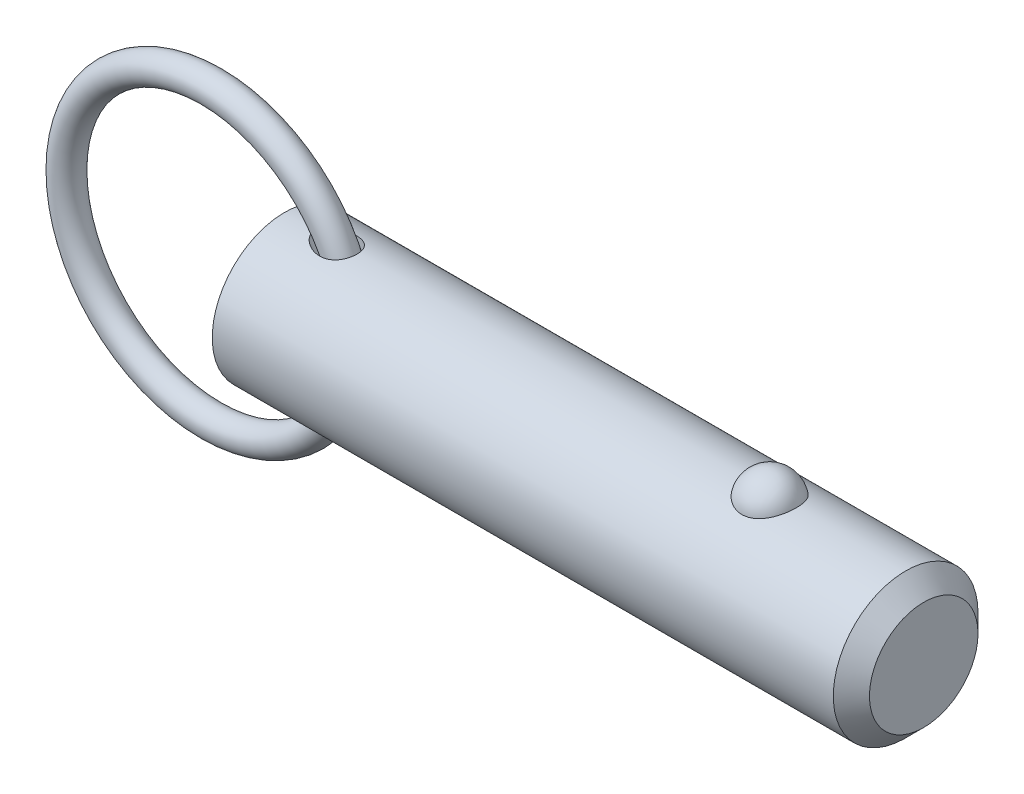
ISO-10303-21;
HEADER;
FILE_DESCRIPTION(('STEP AP214'),'2;1');
FILE_NAME('part.step','',(''),(''),'','','');
FILE_SCHEMA(('AUTOMOTIVE_DESIGN { 1 0 10303 214 1 1 1 1 }'));
ENDSEC;
DATA;
#1=APPLICATION_CONTEXT('core data for automotive mechanical design processes');
#2=APPLICATION_PROTOCOL_DEFINITION('international standard','automotive_design',2000,#1);
#3=PRODUCT_CONTEXT('',#1,'mechanical');
#4=PRODUCT('Part','Part','',(#3));
#5=PRODUCT_RELATED_PRODUCT_CATEGORY('part','',(#4));
#6=PRODUCT_DEFINITION_FORMATION('','',#4);
#7=PRODUCT_DEFINITION_CONTEXT('part definition',#1,'design');
#8=PRODUCT_DEFINITION('design','',#6,#7);
#9=PRODUCT_DEFINITION_SHAPE('','',#8);
#10=(LENGTH_UNIT() NAMED_UNIT(*) SI_UNIT(.MILLI.,.METRE.));
#11=(NAMED_UNIT(*) PLANE_ANGLE_UNIT() SI_UNIT($,.RADIAN.));
#12=(NAMED_UNIT(*) SI_UNIT($,.STERADIAN.) SOLID_ANGLE_UNIT());
#13=UNCERTAINTY_MEASURE_WITH_UNIT(LENGTH_MEASURE(1.E-05),#10,'distance_accuracy_value','');
#14=(GEOMETRIC_REPRESENTATION_CONTEXT(3) GLOBAL_UNCERTAINTY_ASSIGNED_CONTEXT((#13)) GLOBAL_UNIT_ASSIGNED_CONTEXT((#10,
#11,#12)) REPRESENTATION_CONTEXT('',''));
#15=CARTESIAN_POINT('',(0.,0.,0.));
#16=DIRECTION('',(0.,0.,1.));
#17=DIRECTION('',(1.,0.,0.));
#18=AXIS2_PLACEMENT_3D('',#15,#16,#17);
#19=CARTESIAN_POINT('',(-9.66825126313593,0.,0.));
#20=DIRECTION('',(0.,0.,1.));
#21=DIRECTION('',(1.,0.,0.));
#22=AXIS2_PLACEMENT_3D('',#19,#20,#21);
#23=TOROIDAL_SURFACE('',#22,19.05,1.905);
#24=CARTESIAN_POINT('',(11.2867487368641,0.,0.));
#25=VERTEX_POINT('',#24);
#26=VERTEX_LOOP('',#25);
#27=FACE_BOUND('',#26,.T.);
#28=ADVANCED_FACE('P0_F12',(#27),#23,.T.);
#29=CLOSED_SHELL('',(#28));
#30=MANIFOLD_SOLID_BREP('P0_B1',#29);
#31=CARTESIAN_POINT('',(0.,0.,0.));
#32=DIRECTION('',(1.,0.,0.));
#33=DIRECTION('',(0.,0.,-1.));
#34=AXIS2_PLACEMENT_3D('',#31,#32,#33);
#35=CYLINDRICAL_SURFACE('',#34,9.525);
#36=CARTESIAN_POINT('',(4.56693409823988,9.43141941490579,-1.33189820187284));
#37=CARTESIAN_POINT('',(4.70260475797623,9.41020313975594,-1.48215931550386));
#38=CARTESIAN_POINT('',(4.85555680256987,9.38755003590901,-1.61683982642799));
#39=CARTESIAN_POINT('',(5.10171959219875,9.35450554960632,-1.79512943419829));
#40=CARTESIAN_POINT('',(5.18674514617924,9.34362629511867,-1.85068909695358));
#41=CARTESIAN_POINT('',(5.36154389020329,9.32258514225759,-1.95392002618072));
#42=CARTESIAN_POINT('',(5.45131542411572,9.31242299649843,-2.00159402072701));
#43=CARTESIAN_POINT('',(5.70070211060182,9.28632120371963,-2.12033289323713));
#44=CARTESIAN_POINT('',(5.86420408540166,9.27146938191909,-2.18362944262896));
#45=CARTESIAN_POINT('',(6.19893345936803,9.24694163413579,-2.28525783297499));
#46=CARTESIAN_POINT('',(6.37015384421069,9.23726110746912,-2.32361187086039));
#47=CARTESIAN_POINT('',(6.73531776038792,9.22400982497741,-2.37575048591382));
#48=CARTESIAN_POINT('',(6.92975826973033,9.22118808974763,-2.38652934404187));
#49=CARTESIAN_POINT('',(7.21995443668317,9.22416297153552,-2.37494980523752));
#50=CARTESIAN_POINT('',(7.31643847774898,9.22635560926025,-2.366466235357));
#51=CARTESIAN_POINT('',(7.50796421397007,9.2331428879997,-2.33985028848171));
#52=CARTESIAN_POINT('',(7.60300650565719,9.23773650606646,-2.32172202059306));
#53=CARTESIAN_POINT('',(7.83273114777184,9.25183311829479,-2.26504721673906));
#54=CARTESIAN_POINT('',(7.96603028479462,9.26261470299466,-2.2209856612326));
#55=CARTESIAN_POINT('',(8.22310899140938,9.28816519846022,-2.11157306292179));
#56=CARTESIAN_POINT('',(8.34689477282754,9.30293147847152,-2.04623606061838));
#57=CARTESIAN_POINT('',(8.58136049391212,9.3349416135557,-1.89485344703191));
#58=CARTESIAN_POINT('',(8.69199721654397,9.35219324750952,-1.80874222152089));
#59=CARTESIAN_POINT('',(8.89592093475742,9.38707016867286,-1.61799188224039));
#60=CARTESIAN_POINT('',(8.98920771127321,9.40469546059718,-1.51335253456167));
#61=CARTESIAN_POINT('',(9.15057731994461,9.43713590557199,-1.29519427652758));
#62=CARTESIAN_POINT('',(9.21980158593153,9.45205440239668,-1.18253282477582));
#63=CARTESIAN_POINT('',(9.33826736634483,9.47856708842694,-0.946802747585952));
#64=CARTESIAN_POINT('',(9.38751161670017,9.49016173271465,-0.823735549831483));
#65=CARTESIAN_POINT('',(9.46423850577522,9.50859378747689,-0.572614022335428));
#66=CARTESIAN_POINT('',(9.49202393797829,9.5154972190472,-0.444656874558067));
#67=CARTESIAN_POINT('',(9.52636926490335,9.52406905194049,-0.185752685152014));
#68=CARTESIAN_POINT('',(9.53292923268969,9.52573747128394,-0.0548056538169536));
#69=CARTESIAN_POINT('',(9.52467276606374,9.52365852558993,0.206503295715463));
#70=CARTESIAN_POINT('',(9.50983454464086,9.51990564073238,0.336864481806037));
#71=CARTESIAN_POINT('',(9.45907362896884,9.50737852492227,0.59316631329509));
#72=CARTESIAN_POINT('',(9.42315106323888,9.49860432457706,0.71910698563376));
#73=CARTESIAN_POINT('',(9.33106648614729,9.47698928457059,0.96295935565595));
#74=CARTESIAN_POINT('',(9.27490839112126,9.46414923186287,1.08087260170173));
#75=CARTESIAN_POINT('',(9.14375803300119,9.43581000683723,1.30534632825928));
#76=CARTESIAN_POINT('',(9.06876720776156,9.42031103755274,1.41190767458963));
#77=CARTESIAN_POINT('',(8.90203187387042,9.38836719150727,1.61069439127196));
#78=CARTESIAN_POINT('',(8.81029913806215,9.37192298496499,1.70292975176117));
#79=CARTESIAN_POINT('',(8.61268775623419,9.33985045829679,1.87086859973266));
#80=CARTESIAN_POINT('',(8.50680947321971,9.3242221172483,1.94657251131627));
#81=CARTESIAN_POINT('',(8.28220546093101,9.29513431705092,2.08109032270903));
#82=CARTESIAN_POINT('',(8.16329919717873,9.28171415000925,2.1396103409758));
#83=CARTESIAN_POINT('',(7.91756052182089,9.25859072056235,2.23755716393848));
#84=CARTESIAN_POINT('',(7.79072606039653,9.24888842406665,2.27697900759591));
#85=CARTESIAN_POINT('',(7.52377913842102,9.23338749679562,2.33907806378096));
#86=CARTESIAN_POINT('',(7.38334767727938,9.22789571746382,2.36044900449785));
#87=CARTESIAN_POINT('',(7.10081394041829,9.22210229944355,2.3829751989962));
#88=CARTESIAN_POINT('',(6.95871103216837,9.22180269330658,2.38412253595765));
#89=CARTESIAN_POINT('',(6.65642691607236,9.22632724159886,2.36656230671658));
#90=CARTESIAN_POINT('',(6.49641694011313,9.23185415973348,2.3451317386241));
#91=CARTESIAN_POINT('',(6.18115433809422,9.24811737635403,2.28014143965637));
#92=CARTESIAN_POINT('',(6.02590710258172,9.25885936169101,2.23655754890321));
#93=CARTESIAN_POINT('',(5.6990472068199,9.28624254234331,2.12025087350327));
#94=CARTESIAN_POINT('',(5.52873601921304,9.30354853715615,2.04400672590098));
#95=CARTESIAN_POINT('',(5.20289495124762,9.34106989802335,1.86504730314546));
#96=CARTESIAN_POINT('',(5.04735968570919,9.36128419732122,1.76234172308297));
#97=CARTESIAN_POINT('',(4.79287124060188,9.39697639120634,1.55895334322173));
#98=CARTESIAN_POINT('',(4.68938704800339,9.41240250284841,1.46392900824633));
#99=CARTESIAN_POINT('',(4.49847141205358,9.44202586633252,1.25875918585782));
#100=CARTESIAN_POINT('',(4.41101129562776,9.45622528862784,1.1486413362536));
#101=CARTESIAN_POINT('',(4.27502257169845,9.47888210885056,0.940600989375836));
#102=CARTESIAN_POINT('',(4.22216329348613,9.48791121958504,0.845586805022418));
#103=CARTESIAN_POINT('',(4.13241478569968,9.50344321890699,0.648051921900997));
#104=CARTESIAN_POINT('',(4.09551182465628,9.50994827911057,0.545537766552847));
#105=CARTESIAN_POINT('',(4.04043124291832,9.51971586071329,0.334452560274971));
#106=CARTESIAN_POINT('',(4.02240728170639,9.52295176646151,0.225839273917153));
#107=CARTESIAN_POINT('',(4.00750873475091,9.52562364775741,0.00713006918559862));
#108=CARTESIAN_POINT('',(4.01062334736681,9.52506156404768,-0.10296506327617));
#109=CARTESIAN_POINT('',(4.03592967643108,9.52053221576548,-0.306944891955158));
#110=CARTESIAN_POINT('',(4.05571676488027,9.51699426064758,-0.401151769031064));
#111=CARTESIAN_POINT('',(4.10967975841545,9.5074546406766,-0.585176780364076));
#112=CARTESIAN_POINT('',(4.14385995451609,9.50145224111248,-0.674993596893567));
#113=CARTESIAN_POINT('',(4.23261356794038,9.48611703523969,-0.866116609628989));
#114=CARTESIAN_POINT('',(4.28990016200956,9.47635800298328,-0.96612166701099));
#115=CARTESIAN_POINT('',(4.41856577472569,9.45502867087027,-1.15640011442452));
#116=CARTESIAN_POINT('',(4.48996918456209,9.44345524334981,-1.24665623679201));
#117=CARTESIAN_POINT('',(4.56693409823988,9.43141941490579,-1.33189820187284));
#118=B_SPLINE_CURVE_WITH_KNOTS('',3,(#36,#37,#38,#39,#40,#41,#42,#43,#44,#45,#46,#47,#48,#49,
#50,#51,#52,#53,#54,#55,#56,#57,#58,#59,#60,#61,#62,#63,#64,#65,#66,#67,#68,#69,#70,#71,#72,#73,
#74,#75,#76,#77,#78,#79,#80,#81,#82,#83,#84,#85,#86,#87,#88,#89,#90,#91,#92,#93,#94,#95,#96,#97,
#98,#99,#100,#101,#102,#103,#104,#105,#106,#107,#108,#109,#110,#111,#112,#113,#114,#115,#116,
#117),.UNSPECIFIED.,.T.,.F.,(4,2,2,2,2,2,2,2,2,2,2,2,2,2,2,2,2,2,2,2,2,2,2,2,2,2,2,2,2,2,2,2,2,
2,2,2,2,2,2,2,4),(0.,0.609951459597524,0.916123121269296,1.22218863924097,1.74791337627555,
2.27316961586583,2.85362722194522,3.14383229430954,3.43391382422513,3.85437497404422,
4.27455920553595,4.69608835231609,5.11762282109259,5.5149005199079,5.91212379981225,
6.30363414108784,6.69514313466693,7.08705103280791,7.47895654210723,7.87078624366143,
8.26258603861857,8.65411137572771,9.04562666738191,9.44349251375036,9.84146165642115,
10.2662286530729,10.6911619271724,11.1739180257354,11.6572017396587,12.2170157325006,
12.776624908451,13.1992556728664,13.6211226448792,13.9471990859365,14.2729943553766,
14.6014211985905,14.9296802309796,15.2173810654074,15.505167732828,15.8505863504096,
16.1966070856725),.UNSPECIFIED.);
#119=CARTESIAN_POINT('',(4.56693409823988,9.43141941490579,-1.33189820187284));
#120=VERTEX_POINT('',#119);
#121=EDGE_CURVE('P1_E40',#120,#120,#118,.T.);
#122=ORIENTED_EDGE('',*,*,#121,.T.);
#123=EDGE_LOOP('',(#122));
#124=FACE_BOUND('',#123,.T.);
#125=CARTESIAN_POINT('',(81.74875,0.,0.));
#126=DIRECTION('',(1.,0.,0.));
#127=DIRECTION('',(0.,0.,-1.));
#128=AXIS2_PLACEMENT_3D('',#125,#126,#127);
#129=CIRCLE('',#128,9.525);
#130=CARTESIAN_POINT('',(81.74875,0.,-9.525));
#131=VERTEX_POINT('',#130);
#132=EDGE_CURVE('P1_E25',#131,#131,#129,.T.);
#133=ORIENTED_EDGE('',*,*,#132,.F.);
#134=EDGE_LOOP('',(#133));
#135=FACE_BOUND('',#134,.T.);
#136=CARTESIAN_POINT('',(0.,0.,0.));
#137=DIRECTION('',(1.,0.,0.));
#138=DIRECTION('',(0.,0.,-1.));
#139=AXIS2_PLACEMENT_3D('',#136,#137,#138);
#140=CIRCLE('',#139,9.525);
#141=CARTESIAN_POINT('',(0.,0.,-9.525));
#142=VERTEX_POINT('',#141);
#143=EDGE_CURVE('P1_E9',#142,#142,#140,.T.);
#144=ORIENTED_EDGE('',*,*,#143,.T.);
#145=EDGE_LOOP('',(#144));
#146=FACE_BOUND('',#145,.T.);
#147=CARTESIAN_POINT('',(63.8457573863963,8.80405803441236,3.63513233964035));
#148=CARTESIAN_POINT('',(63.7516766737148,8.80405953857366,3.63513053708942));
#149=CARTESIAN_POINT('',(63.6575618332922,8.80561325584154,3.6313746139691));
#150=CARTESIAN_POINT('',(63.4700126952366,8.81177748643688,3.61638665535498));
#151=CARTESIAN_POINT('',(63.3765788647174,8.81638992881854,3.60514990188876));
#152=CARTESIAN_POINT('',(63.0979452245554,8.8346711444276,3.56024627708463));
#153=CARTESIAN_POINT('',(62.9146916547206,8.85278327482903,3.51538626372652));
#154=CARTESIAN_POINT('',(62.559509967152,8.89871214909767,3.39742145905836));
#155=CARTESIAN_POINT('',(62.3875533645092,8.92650327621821,3.32439116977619));
#156=CARTESIAN_POINT('',(62.0587075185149,8.98874819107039,3.15220244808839));
#157=CARTESIAN_POINT('',(61.9018114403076,9.02319893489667,3.05305594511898));
#158=CARTESIAN_POINT('',(61.6022147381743,9.09629186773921,2.82797815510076));
#159=CARTESIAN_POINT('',(61.4600600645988,9.13502685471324,2.7013513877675));
#160=CARTESIAN_POINT('',(61.1982999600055,9.2118657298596,2.4264193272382));
#161=CARTESIAN_POINT('',(61.0787015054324,9.2499694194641,2.27810735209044));
#162=CARTESIAN_POINT('',(60.859645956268,9.32341082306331,1.95652290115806));
#163=CARTESIAN_POINT('',(60.7613174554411,9.35855090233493,1.78243511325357));
#164=CARTESIAN_POINT('',(60.5938190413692,9.42045142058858,1.41937246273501));
#165=CARTESIAN_POINT('',(60.5246511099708,9.44721128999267,1.23039658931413));
#166=CARTESIAN_POINT('',(60.4161994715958,9.48990641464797,0.840370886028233));
#167=CARTESIAN_POINT('',(60.3772880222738,9.50570658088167,0.639202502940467));
#168=CARTESIAN_POINT('',(60.3315550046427,9.52433146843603,0.232664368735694));
#169=CARTESIAN_POINT('',(60.3247324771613,9.52715657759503,0.0272947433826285));
#170=CARTESIAN_POINT('',(60.343255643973,9.51956918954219,-0.380478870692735));
#171=CARTESIAN_POINT('',(60.3684052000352,9.50923740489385,-0.582893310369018));
#172=CARTESIAN_POINT('',(60.4500253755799,9.47651897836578,-0.980293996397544));
#173=CARTESIAN_POINT('',(60.5064966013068,9.45413210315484,-1.17528009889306));
#174=CARTESIAN_POINT('',(60.6497192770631,9.39954044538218,-1.55263697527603));
#175=CARTESIAN_POINT('',(60.7365124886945,9.36732213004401,-1.73498993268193));
#176=CARTESIAN_POINT('',(60.9386103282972,9.29640700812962,-2.08177763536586));
#177=CARTESIAN_POINT('',(61.0539172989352,9.25770966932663,-2.24621090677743));
#178=CARTESIAN_POINT('',(61.311264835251,9.17775604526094,-2.5533833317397));
#179=CARTESIAN_POINT('',(61.4534344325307,9.136488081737,-2.69601150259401));
#180=CARTESIAN_POINT('',(61.76089985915,9.05620497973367,-2.95451229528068));
#181=CARTESIAN_POINT('',(61.9261937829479,9.01718965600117,-3.07038711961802));
#182=CARTESIAN_POINT('',(62.272052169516,8.9468001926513,-3.26976836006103));
#183=CARTESIAN_POINT('',(62.4522278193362,8.91528408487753,-3.35389750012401));
#184=CARTESIAN_POINT('',(62.8256514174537,8.86272514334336,-3.49043503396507));
#185=CARTESIAN_POINT('',(63.0188944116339,8.8416783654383,-3.54285537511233));
#186=CARTESIAN_POINT('',(63.4025036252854,8.81348056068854,-3.61241306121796));
#187=CARTESIAN_POINT('',(63.5925251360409,8.80568348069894,-3.63119339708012));
#188=CARTESIAN_POINT('',(63.9731906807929,8.80289410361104,-3.63795342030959));
#189=CARTESIAN_POINT('',(64.1638345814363,8.80789922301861,-3.62593932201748));
#190=CARTESIAN_POINT('',(64.534007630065,8.8297491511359,-3.57238430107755));
#191=CARTESIAN_POINT('',(64.7136976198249,8.84621463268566,-3.53178890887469));
#192=CARTESIAN_POINT('',(65.063422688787,8.88875330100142,-3.42331083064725));
#193=CARTESIAN_POINT('',(65.2334569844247,8.91482726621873,-3.35542593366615));
#194=CARTESIAN_POINT('',(65.5632377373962,8.97448239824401,-3.19248225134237));
#195=CARTESIAN_POINT('',(65.7226801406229,9.00821446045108,-3.09686474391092));
#196=CARTESIAN_POINT('',(66.0235136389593,9.07935398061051,-2.88162736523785));
#197=CARTESIAN_POINT('',(66.1649005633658,9.11676228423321,-2.76200196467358));
#198=CARTESIAN_POINT('',(66.4333193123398,9.19347419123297,-2.49516285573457));
#199=CARTESIAN_POINT('',(66.5592750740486,9.23277872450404,-2.34686614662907));
#200=CARTESIAN_POINT('',(66.7855227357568,9.30737610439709,-2.03093683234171));
#201=CARTESIAN_POINT('',(66.8858100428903,9.34266823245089,-1.86330077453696));
#202=CARTESIAN_POINT('',(67.0615149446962,9.40674710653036,-1.50744893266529));
#203=CARTESIAN_POINT('',(67.136041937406,9.4352917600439,-1.31874876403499));
#204=CARTESIAN_POINT('',(67.2541650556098,9.48144132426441,-0.930631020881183));
#205=CARTESIAN_POINT('',(67.2977608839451,9.49904612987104,-0.731213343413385));
#206=CARTESIAN_POINT('',(67.3531580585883,9.5215314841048,-0.327147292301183));
#207=CARTESIAN_POINT('',(67.3649354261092,9.52640243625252,-0.122495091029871));
#208=CARTESIAN_POINT('',(67.3563825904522,9.52289571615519,0.286018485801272));
#209=CARTESIAN_POINT('',(67.3360530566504,9.51451832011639,0.48987987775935));
#210=CARTESIAN_POINT('',(67.2638840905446,9.48544083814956,0.889994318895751));
#211=CARTESIAN_POINT('',(67.2121993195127,9.46480124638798,1.08627971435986));
#212=CARTESIAN_POINT('',(67.0784917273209,9.41333895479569,1.46682086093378));
#213=CARTESIAN_POINT('',(66.9964668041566,9.38251554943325,1.65107577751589));
#214=CARTESIAN_POINT('',(66.8031929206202,9.31365636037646,2.00346348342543));
#215=CARTESIAN_POINT('',(66.6917838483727,9.27558138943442,2.17150083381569));
#216=CARTESIAN_POINT('',(66.4422947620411,9.19638714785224,2.4856311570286));
#217=CARTESIAN_POINT('',(66.3042163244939,9.15526805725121,2.63172542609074));
#218=CARTESIAN_POINT('',(66.0048438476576,9.07465393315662,2.89750997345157));
#219=CARTESIAN_POINT('',(65.8436109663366,9.03515496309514,3.01726776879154));
#220=CARTESIAN_POINT('',(65.5016136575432,8.96227564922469,3.22732920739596));
#221=CARTESIAN_POINT('',(65.320841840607,8.92889763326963,3.31762165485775));
#222=CARTESIAN_POINT('',(64.9514451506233,8.8734538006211,3.46314419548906));
#223=CARTESIAN_POINT('',(64.7633237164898,8.85102983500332,3.51950082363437));
#224=CARTESIAN_POINT('',(64.4757869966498,8.8266696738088,3.57993683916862));
#225=CARTESIAN_POINT('',(64.3791339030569,8.82009725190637,3.59606217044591));
#226=CARTESIAN_POINT('',(64.1846770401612,8.81020897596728,3.62022512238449));
#227=CARTESIAN_POINT('',(64.0868741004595,8.80689090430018,3.62826825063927));
#228=CARTESIAN_POINT('',(63.9412243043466,8.80445615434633,3.63416760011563));
#229=CARTESIAN_POINT('',(63.8934952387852,8.80405727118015,3.63513325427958));
#230=CARTESIAN_POINT('',(63.8457573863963,8.80405803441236,3.63513233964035));
#231=B_SPLINE_CURVE_WITH_KNOTS('',3,(#147,#148,#149,#150,#151,#152,#153,#154,#155,#156,#157,
#158,#159,#160,#161,#162,#163,#164,#165,#166,#167,#168,#169,#170,#171,#172,#173,#174,#175,#176,
#177,#178,#179,#180,#181,#182,#183,#184,#185,#186,#187,#188,#189,#190,#191,#192,#193,#194,#195,
#196,#197,#198,#199,#200,#201,#202,#203,#204,#205,#206,#207,#208,#209,#210,#211,#212,#213,#214,
#215,#216,#217,#218,#219,#220,#221,#222,#223,#224,#225,#226,#227,#228,#229,#230),.UNSPECIFIED.,
.T.,.F.,(4,2,2,2,2,2,2,2,2,2,2,2,2,2,2,2,2,2,2,2,2,2,2,2,2,2,2,2,2,2,2,2,2,2,2,2,2,2,2,2,2,4),
(0.,0.282202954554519,0.564584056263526,1.13017050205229,1.69427128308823,2.25811483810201,
2.83836627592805,3.41879688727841,4.02497117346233,4.63118665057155,5.24474754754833,
5.85829010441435,6.46808687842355,7.0778954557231,7.68854723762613,8.29924920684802,
8.91296283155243,9.52662591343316,10.1275338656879,10.7282152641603,11.2986646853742,
11.868998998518,12.4213015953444,12.973648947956,13.5380053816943,14.1024919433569,
14.695298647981,15.2882113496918,15.8999469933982,16.5116885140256,17.1238909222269,
17.7360805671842,18.3452748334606,18.9545113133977,19.567138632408,20.1797297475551,
20.7907316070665,21.4019653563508,21.9915938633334,22.2859053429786,22.580016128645,
22.723209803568),.UNSPECIFIED.);
#232=CARTESIAN_POINT('',(63.8457573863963,8.80405803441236,3.63513233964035));
#233=VERTEX_POINT('',#232);
#234=EDGE_CURVE('P1_E34',#233,#233,#231,.T.);
#235=ORIENTED_EDGE('',*,*,#234,.T.);
#236=EDGE_LOOP('',(#235));
#237=FACE_BOUND('',#236,.T.);
#238=CARTESIAN_POINT('',(4.56693409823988,-9.43141941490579,-1.33189820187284));
#239=CARTESIAN_POINT('',(4.48932984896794,-9.4435553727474,-1.24594548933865));
#240=CARTESIAN_POINT('',(4.41737309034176,-9.45522193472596,-1.1548795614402));
#241=CARTESIAN_POINT('',(4.2878104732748,-9.47670896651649,-0.962782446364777));
#242=CARTESIAN_POINT('',(4.23019403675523,-9.48653079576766,-0.861758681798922));
#243=CARTESIAN_POINT('',(4.13254559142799,-9.5034118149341,-0.649723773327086));
#244=CARTESIAN_POINT('',(4.09271158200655,-9.51043980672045,-0.538615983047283));
#245=CARTESIAN_POINT('',(4.04973167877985,-9.51806966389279,-0.367764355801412));
#246=CARTESIAN_POINT('',(4.03820037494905,-9.52012756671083,-0.310118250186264));
#247=CARTESIAN_POINT('',(4.02100287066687,-9.52320274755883,-0.193935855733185));
#248=CARTESIAN_POINT('',(4.01533565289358,-9.52422020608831,-0.13539972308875));
#249=CARTESIAN_POINT('',(4.00817074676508,-9.52550497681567,0.0247266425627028));
#250=CARTESIAN_POINT('',(4.01270492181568,-9.52468821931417,0.126661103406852));
#251=CARTESIAN_POINT('',(4.0395497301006,-9.51988506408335,0.328012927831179));
#252=CARTESIAN_POINT('',(4.0618645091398,-9.51589792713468,0.427429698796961));
#253=CARTESIAN_POINT('',(4.12088980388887,-9.5054852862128,0.61636200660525));
#254=CARTESIAN_POINT('',(4.15684838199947,-9.49918763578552,0.706123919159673));
#255=CARTESIAN_POINT('',(4.24094647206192,-9.48470618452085,0.879522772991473));
#256=CARTESIAN_POINT('',(4.28909090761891,-9.47652162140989,0.96315722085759));
#257=CARTESIAN_POINT('',(4.42295891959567,-9.45426317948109,1.16513741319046));
#258=CARTESIAN_POINT('',(4.51523752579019,-9.43933320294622,1.27905352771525));
#259=CARTESIAN_POINT('',(4.71682295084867,-9.40825940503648,1.49055892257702));
#260=CARTESIAN_POINT('',(4.8261728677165,-9.39211256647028,1.58810554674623));
#261=CARTESIAN_POINT('',(5.09064226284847,-9.35555264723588,1.79246125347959));
#262=CARTESIAN_POINT('',(5.24990411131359,-9.33524115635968,1.89393122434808));
#263=CARTESIAN_POINT('',(5.58309255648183,-9.29785396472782,2.06968659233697));
#264=CARTESIAN_POINT('',(5.75702897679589,-9.28078045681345,2.14395359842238));
#265=CARTESIAN_POINT('',(6.11646882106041,-9.25213303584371,2.26440412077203));
#266=CARTESIAN_POINT('',(6.3020558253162,-9.2406056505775,2.31035092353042));
#267=CARTESIAN_POINT('',(6.67856093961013,-9.22541807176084,2.37029728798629));
#268=CARTESIAN_POINT('',(6.86947045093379,-9.2217458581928,2.3843456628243));
#269=CARTESIAN_POINT('',(7.21217144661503,-9.22344239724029,2.37775005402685));
#270=CARTESIAN_POINT('',(7.36409439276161,-9.22713860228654,2.36352577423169));
#271=CARTESIAN_POINT('',(7.66346227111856,-9.24048072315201,2.31082299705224));
#272=CARTESIAN_POINT('',(7.81090958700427,-9.25012341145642,2.27235765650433));
#273=CARTESIAN_POINT('',(8.09730316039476,-9.2746609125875,2.17003648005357));
#274=CARTESIAN_POINT('',(8.23619652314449,-9.28958517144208,2.10603803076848));
#275=CARTESIAN_POINT('',(8.49918675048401,-9.32290326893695,1.9532444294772));
#276=CARTESIAN_POINT('',(8.62328895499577,-9.34129584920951,1.86445826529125));
#277=CARTESIAN_POINT('',(8.84006515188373,-9.37706953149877,1.67466761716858));
#278=CARTESIAN_POINT('',(8.93465172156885,-9.39436331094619,1.57582357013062));
#279=CARTESIAN_POINT('',(9.1049023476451,-9.42761680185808,1.362809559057));
#280=CARTESIAN_POINT('',(9.18057146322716,-9.44357686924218,1.24864370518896));
#281=CARTESIAN_POINT('',(9.30789178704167,-9.47159985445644,1.01379272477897));
#282=CARTESIAN_POINT('',(9.3604554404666,-9.48380365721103,0.893617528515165));
#283=CARTESIAN_POINT('',(9.44498362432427,-9.50388751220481,0.645890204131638));
#284=CARTESIAN_POINT('',(9.47694947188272,-9.51176784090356,0.518338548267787));
#285=CARTESIAN_POINT('',(9.51944262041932,-9.52232073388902,0.260103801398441));
#286=CARTESIAN_POINT('',(9.53006646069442,-9.52501674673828,0.129437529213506));
#287=CARTESIAN_POINT('',(9.52993291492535,-9.52498309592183,-0.131885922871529));
#288=CARTESIAN_POINT('',(9.51917525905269,-9.52225336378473,-0.262543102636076));
#289=CARTESIAN_POINT('',(9.47648788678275,-9.51165418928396,-0.520312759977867));
#290=CARTESIAN_POINT('',(9.44453086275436,-9.50377811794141,-0.647420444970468));
#291=CARTESIAN_POINT('',(9.36015568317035,-9.48373425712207,-0.894290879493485));
#292=CARTESIAN_POINT('',(9.30773827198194,-9.47156662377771,-1.01405389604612));
#293=CARTESIAN_POINT('',(9.18380895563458,-9.44428888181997,-1.24269386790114));
#294=CARTESIAN_POINT('',(9.11232064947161,-9.42918241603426,-1.3515840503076));
#295=CARTESIAN_POINT('',(8.95212687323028,-9.39767706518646,-1.55562459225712));
#296=CARTESIAN_POINT('',(8.86342281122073,-9.3812782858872,-1.65077607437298));
#297=CARTESIAN_POINT('',(8.67104443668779,-9.34891827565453,-1.82517515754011));
#298=CARTESIAN_POINT('',(8.56732858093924,-9.33295841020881,-1.90437711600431));
#299=CARTESIAN_POINT('',(8.34818438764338,-9.30317889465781,-2.0449122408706));
#300=CARTESIAN_POINT('',(8.23275529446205,-9.2893593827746,-2.10624425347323));
#301=CARTESIAN_POINT('',(7.98961240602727,-9.26475003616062,-2.2120340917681));
#302=CARTESIAN_POINT('',(7.86162088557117,-9.25407358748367,-2.25587700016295));
#303=CARTESIAN_POINT('',(7.60027499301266,-9.23720810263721,-2.32397032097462));
#304=CARTESIAN_POINT('',(7.46691858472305,-9.23102078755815,-2.34821321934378));
#305=CARTESIAN_POINT('',(7.18516230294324,-9.22302718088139,-2.37943079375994));
#306=CARTESIAN_POINT('',(7.0365445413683,-9.22169704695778,-2.38452997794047));
#307=CARTESIAN_POINT('',(6.74015049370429,-9.22442327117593,-2.37395141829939));
#308=CARTESIAN_POINT('',(6.59237455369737,-9.22848170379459,-2.35826567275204));
#309=CARTESIAN_POINT('',(6.27762777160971,-9.2422287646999,-2.30385559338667));
#310=CARTESIAN_POINT('',(6.11124715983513,-9.25269504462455,-2.26192683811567));
#311=CARTESIAN_POINT('',(5.78635920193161,-9.27830776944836,-2.15445569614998));
#312=CARTESIAN_POINT('',(5.62786567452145,-9.29346211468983,-2.08887341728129));
#313=CARTESIAN_POINT('',(5.3901306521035,-9.31931237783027,-1.96924953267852));
#314=CARTESIAN_POINT('',(5.30683088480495,-9.32901725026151,-1.92292485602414));
#315=CARTESIAN_POINT('',(5.14455801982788,-9.34899035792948,-1.82334419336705));
#316=CARTESIAN_POINT('',(5.06558607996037,-9.35925874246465,-1.77008636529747));
#317=CARTESIAN_POINT('',(4.83670950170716,-9.39034445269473,-1.60010986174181));
#318=CARTESIAN_POINT('',(4.69422471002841,-9.41151337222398,-1.47288240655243));
#319=CARTESIAN_POINT('',(4.56693409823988,-9.43141941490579,-1.33189820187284));
#320=B_SPLINE_CURVE_WITH_KNOTS('',3,(#238,#239,#240,#241,#242,#243,#244,#245,#246,#247,#248,
#249,#250,#251,#252,#253,#254,#255,#256,#257,#258,#259,#260,#261,#262,#263,#264,#265,#266,#267,
#268,#269,#270,#271,#272,#273,#274,#275,#276,#277,#278,#279,#280,#281,#282,#283,#284,#285,#286,
#287,#288,#289,#290,#291,#292,#293,#294,#295,#296,#297,#298,#299,#300,#301,#302,#303,#304,#305,
#306,#307,#308,#309,#310,#311,#312,#313,#314,#315,#316,#317,#318,#319),.UNSPECIFIED.,.T.,.F.,(4,
2,2,2,2,2,2,2,2,2,2,2,2,2,2,2,2,2,2,2,2,2,2,2,2,2,2,2,2,2,2,2,2,2,2,2,2,2,2,2,4),(0.,
0.348900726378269,0.697543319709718,1.0499765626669,1.22617690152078,1.40234666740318,
1.70666745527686,2.01105922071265,2.30066493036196,2.59038784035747,3.03001384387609,
3.4707682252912,4.03766594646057,4.60494622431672,5.17690598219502,5.74798989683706,
6.2040084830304,6.65977977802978,7.11813321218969,7.57632066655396,7.98791759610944,
8.39940433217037,8.79273459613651,9.18603970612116,9.577561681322,9.96908859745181,
10.3611208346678,10.7531388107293,11.1446739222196,11.536177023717,11.9287850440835,
12.3214184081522,12.7268448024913,13.1324265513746,13.5768390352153,14.0214226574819,
14.5351685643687,15.0497849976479,15.3368801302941,15.6240516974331,16.1963372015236),.UNSPECIFIED.);
#321=CARTESIAN_POINT('',(4.56693409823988,-9.43141941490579,-1.33189820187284));
#322=VERTEX_POINT('',#321);
#323=EDGE_CURVE('P1_E17',#322,#322,#320,.T.);
#324=ORIENTED_EDGE('',*,*,#323,.T.);
#325=EDGE_LOOP('',(#324));
#326=FACE_BOUND('',#325,.T.);
#327=ADVANCED_FACE('P1_F13',(#124,#135,#146,#237,#326),#35,.T.);
#328=CARTESIAN_POINT('',(0.,0.,0.));
#329=DIRECTION('',(-1.,0.,0.));
#330=DIRECTION('',(0.,0.,1.));
#331=AXIS2_PLACEMENT_3D('',#328,#329,#330);
#332=PLANE('',#331);
#333=ORIENTED_EDGE('',*,*,#143,.F.);
#334=EDGE_LOOP('',(#333));
#335=FACE_BOUND('',#334,.T.);
#336=ADVANCED_FACE('P1_F15',(#335),#332,.T.);
#337=CARTESIAN_POINT('',(84.13,0.,0.));
#338=DIRECTION('',(-1.,0.,0.));
#339=DIRECTION('',(0.,0.,1.));
#340=AXIS2_PLACEMENT_3D('',#337,#338,#339);
#341=CONICAL_SURFACE('',#340,7.14375000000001,0.785398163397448);
#342=ORIENTED_EDGE('',*,*,#132,.T.);
#343=EDGE_LOOP('',(#342));
#344=FACE_BOUND('',#343,.T.);
#345=CARTESIAN_POINT('',(84.13,0.,0.));
#346=DIRECTION('',(1.,0.,0.));
#347=DIRECTION('',(0.,0.,-1.));
#348=AXIS2_PLACEMENT_3D('',#345,#346,#347);
#349=CIRCLE('',#348,7.14375000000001);
#350=CARTESIAN_POINT('',(84.13,0.,-7.14375000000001));
#351=VERTEX_POINT('',#350);
#352=EDGE_CURVE('P1_E30',#351,#351,#349,.T.);
#353=ORIENTED_EDGE('',*,*,#352,.F.);
#354=EDGE_LOOP('',(#353));
#355=FACE_BOUND('',#354,.T.);
#356=ADVANCED_FACE('P1_F55',(#344,#355),#341,.T.);
#357=CARTESIAN_POINT('',(84.13,7.14375000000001,0.));
#358=DIRECTION('',(1.,0.,0.));
#359=DIRECTION('',(0.,0.,-1.));
#360=AXIS2_PLACEMENT_3D('',#357,#358,#359);
#361=PLANE('',#360);
#362=ORIENTED_EDGE('',*,*,#352,.T.);
#363=EDGE_LOOP('',(#362));
#364=FACE_BOUND('',#363,.T.);
#365=ADVANCED_FACE('P1_F51',(#364),#361,.T.);
#366=CARTESIAN_POINT('',(63.8457573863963,8.57249999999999,0.));
#367=DIRECTION('',(-1.,0.,0.));
#368=DIRECTION('',(0.,1.,0.));
#369=AXIS2_PLACEMENT_3D('',#366,#367,#368);
#370=SPHERICAL_SURFACE('',#369,3.64250000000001);
#371=ORIENTED_EDGE('',*,*,#234,.F.);
#372=EDGE_LOOP('',(#371));
#373=FACE_BOUND('',#372,.T.);
#374=ADVANCED_FACE('P1_F46',(#373),#370,.T.);
#375=CARTESIAN_POINT('',(-9.66825126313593,0.,0.));
#376=DIRECTION('',(0.,0.,1.));
#377=DIRECTION('',(1.,0.,0.));
#378=AXIS2_PLACEMENT_3D('',#375,#376,#377);
#379=TOROIDAL_SURFACE('',#378,19.05,2.38125);
#380=ORIENTED_EDGE('',*,*,#323,.F.);
#381=EDGE_LOOP('',(#380));
#382=FACE_BOUND('',#381,.T.);
#383=ORIENTED_EDGE('',*,*,#121,.F.);
#384=EDGE_LOOP('',(#383));
#385=FACE_BOUND('',#384,.T.);
#386=ADVANCED_FACE('P1_F50',(#382,#385),#379,.F.);
#387=CLOSED_SHELL('',(#327,#336,#356,#365,#374,#386));
#388=MANIFOLD_SOLID_BREP('P1_B1',#387);
#389=ADVANCED_BREP_SHAPE_REPRESENTATION('',(#18,#30,#388),#14);
#390=SHAPE_DEFINITION_REPRESENTATION(#9,#389);
ENDSEC;
END-ISO-10303-21;
